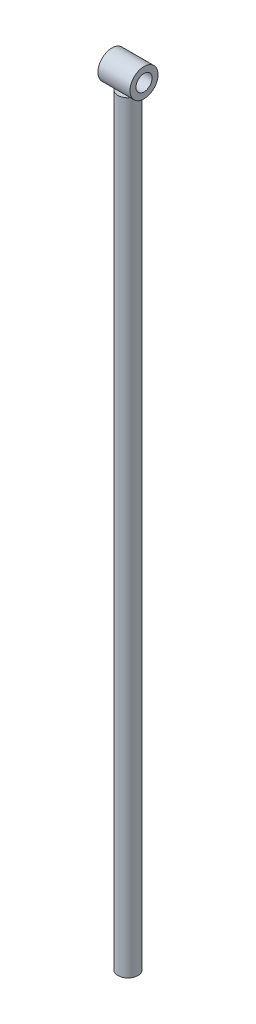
from build123d import *

# Parameters (mm, degrees)
ESQUISSE1_R      = 12.5
EXTRUSION1_DEPTH = 950
ESQUISSE2_R      = 17.5
ESQUISSE2_R_2    = 10
EXTRUSION2_DEPTH = 20


with BuildPart() as part:
    # Esquisse1 → Extrusion1 (new body)
    with BuildSketch(Plane(origin=(0, 0, 0), x_dir=(1, 0, 0), z_dir=(0, 1, 0))):
        with Locations(Location((0, 0, 0), (0, 0, 90))):
            Circle(ESQUISSE1_R)
    extrude(amount=EXTRUSION1_DEPTH)


with BuildPart() as body_2:
    # Esquisse2 → Extrusion2 (new, symmetric)
    with BuildSketch(Plane(origin=(0, 0, 0), x_dir=(0, 0, -1), z_dir=(1, 0, 0))):
        with Locations((0, 967.5)):
            Circle(ESQUISSE2_R)
        with Locations((0, 967.5)):
            Circle(ESQUISSE2_R_2, mode=Mode.SUBTRACT)
    extrude(amount=EXTRUSION2_DEPTH, both=True)


solid = Compound([part.part, body_2.part])
